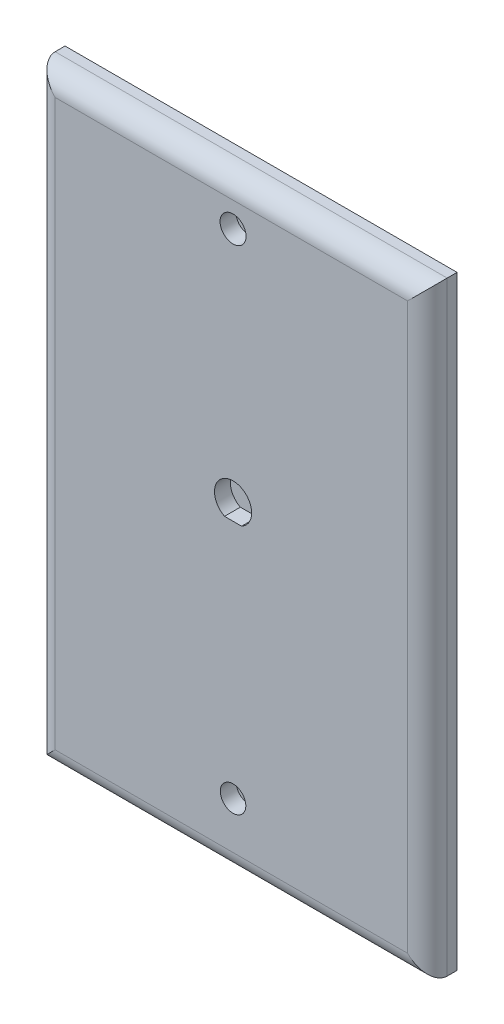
from build123d import *

# Parameters (mm, degrees)
SKETCH1_W          = 201.232511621
SKETCH1_H          = 310.312135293
EXTRUDE1_DEPTH     = 15.24
SKETCH2_R          = 6.672707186
SKETCH2_R_2        = 6.548843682
CUT_EXTRUDE1_DEPTH = 8.128
FILLET1_R          = 10.16


with BuildPart() as part:
    # Sketch1 → Extrude1 (new body)
    with BuildSketch(Plane.XY):
        with Locations((-13.812785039, -10.715683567)):
            Rectangle(SKETCH1_W, SKETCH1_H)
    extrude(amount=EXTRUDE1_DEPTH)

    # Sketch2 → Cut-Extrude1 (cut)
    with BuildSketch(Plane.XY.offset(15.24)):
        with Locations((-12.935425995, 121.483730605)):
            Circle(SKETCH2_R)
        with Locations((-12.935425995, -131.710621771)):
            Circle(SKETCH2_R_2)
        with BuildLine():
            Line((-17.327987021, -8.451688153), (-8.542864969, -8.451688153))
            ThreePointArc((-8.542864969, -8.451688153), (-12.935425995, 9.525), (-17.327987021, -8.451688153))
        make_face()
    extrude(amount=-CUT_EXTRUDE1_DEPTH, mode=Mode.SUBTRACT)

    # Fillet1
    fillet1_edges = [part.edges().sort_by_distance(p)[0] for p in [
        (86.803470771, -10.715683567, 15.24),
        (-13.81278504, 144.44038408, 15.24),
        (-114.42904085, -10.715683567, 15.24),
        (-13.81278504, -165.871751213, 15.24),
    ]]
    fillet(fillet1_edges, radius=FILLET1_R)


solid = part.part
